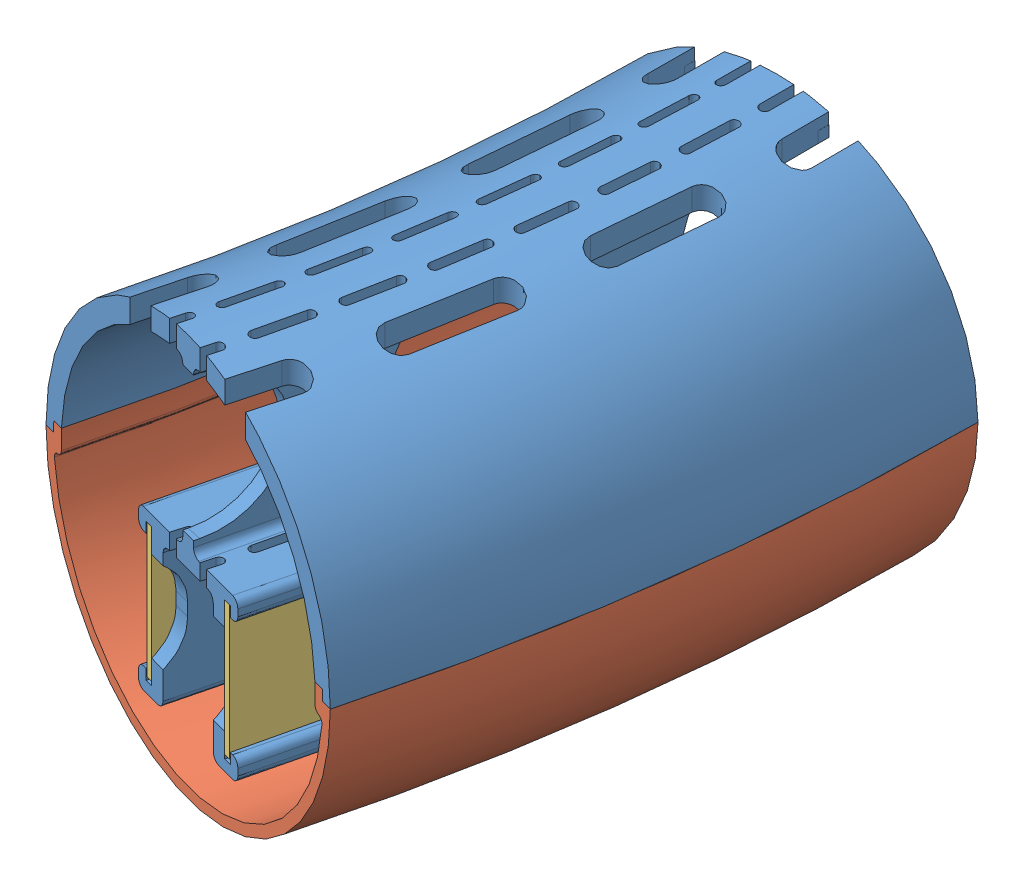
SolidWorks assembly min_15.SLDASM, configuration По умолчанию (file format 12000). Lengths in mm.
Overall size (34.6 30 42.71).
3 component instances, 3 part files, 5 mates.
Components (placement in the parent):
- min_frame-1: min_frame.SLDPRT [По умолчанию] at (-122.2259 30.5048 -5.4377) size (34.6 25.85 42.71)
- min_glass-1: min_glass.SLDPRT [По умолчанию] at (-122.2259 30.5048 -5.4377) size (34.6 15.78 42.71)
- min_led-1: min_led.SLDPRT [По умолчанию] at (-122.2259 30.5048 -5.4377) size (13.66 10 39.95)
Mates (geometry in assembly coordinates):
- Совпадение1: coincident aligned: circle of min_frame-1; circle of min_glass-1
- Совпадение2: coincident aligned: plane of min_frame-1 through (22.663 30.5048 33.3852) normal (-0.258819 0 0.965926); plane of min_glass-1 through (-122.2259 30.5048 -5.4377) normal (-0.258819 0 0.965926)
- Концентричный1: concentric aligned: circle of min_frame-1; circle of min_led-1
- Совпадение3: coincident anti-aligned: plane of min_frame-1 through (26.9613 30.7548 34.5369) normal (0 -1 0); plane of min_led-1 through (-122.2259 30.7548 -5.4377) normal (0 1 0)
- Совпадение4: coincident aligned: plane of min_frame-1 through (22.663 30.3548 33.3852) normal (-0.258819 0 0.965926); plane of min_led-1 through (-122.2259 30.5048 -5.4377) normal (-0.258819 0 0.965926)
